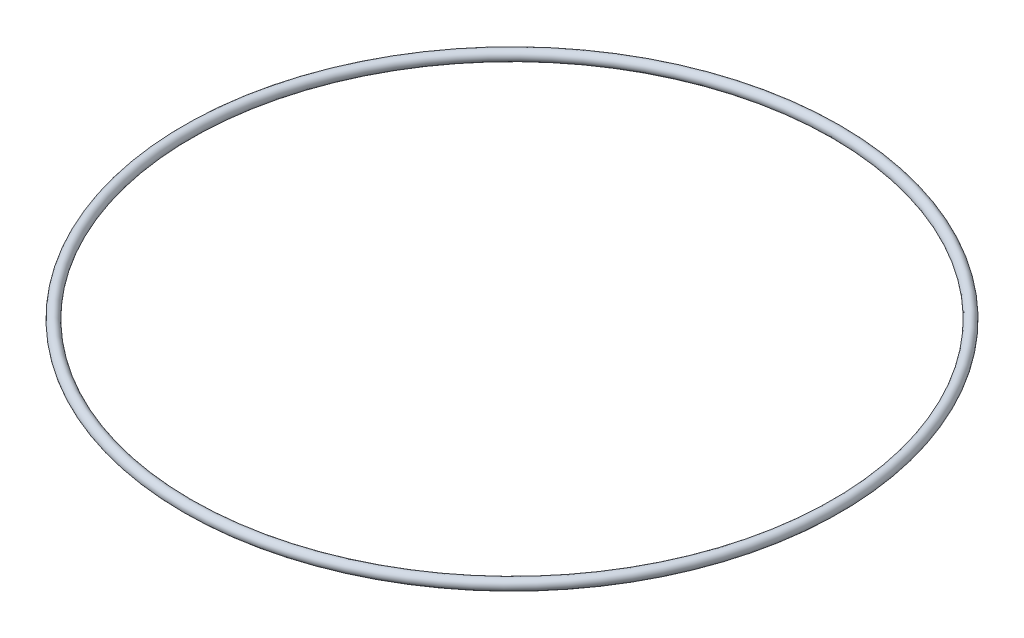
ISO-10303-21;
HEADER;
FILE_DESCRIPTION(('STEP AP214'),'2;1');
FILE_NAME('part.step','',(''),(''),'','','');
FILE_SCHEMA(('AUTOMOTIVE_DESIGN { 1 0 10303 214 1 1 1 1 }'));
ENDSEC;
DATA;
#1=APPLICATION_CONTEXT('core data for automotive mechanical design processes');
#2=APPLICATION_PROTOCOL_DEFINITION('international standard','automotive_design',2000,#1);
#3=PRODUCT_CONTEXT('',#1,'mechanical');
#4=PRODUCT('Part','Part','',(#3));
#5=PRODUCT_RELATED_PRODUCT_CATEGORY('part','',(#4));
#6=PRODUCT_DEFINITION_FORMATION('','',#4);
#7=PRODUCT_DEFINITION_CONTEXT('part definition',#1,'design');
#8=PRODUCT_DEFINITION('design','',#6,#7);
#9=PRODUCT_DEFINITION_SHAPE('','',#8);
#10=(LENGTH_UNIT() NAMED_UNIT(*) SI_UNIT(.MILLI.,.METRE.));
#11=(NAMED_UNIT(*) PLANE_ANGLE_UNIT() SI_UNIT($,.RADIAN.));
#12=(NAMED_UNIT(*) SI_UNIT($,.STERADIAN.) SOLID_ANGLE_UNIT());
#13=UNCERTAINTY_MEASURE_WITH_UNIT(LENGTH_MEASURE(1.E-05),#10,'distance_accuracy_value','');
#14=(GEOMETRIC_REPRESENTATION_CONTEXT(3) GLOBAL_UNCERTAINTY_ASSIGNED_CONTEXT((#13)) GLOBAL_UNIT_ASSIGNED_CONTEXT((#10,
#11,#12)) REPRESENTATION_CONTEXT('',''));
#15=CARTESIAN_POINT('',(0.,0.,0.));
#16=DIRECTION('',(0.,0.,1.));
#17=DIRECTION('',(1.,0.,0.));
#18=AXIS2_PLACEMENT_3D('',#15,#16,#17);
#19=CARTESIAN_POINT('',(0.,0.,0.));
#20=DIRECTION('',(0.,1.,0.));
#21=DIRECTION('',(0.,0.,1.));
#22=AXIS2_PLACEMENT_3D('',#19,#20,#21);
#23=TOROIDAL_SURFACE('',#22,92.5,1.5);
#24=CARTESIAN_POINT('',(0.,0.,94.));
#25=VERTEX_POINT('',#24);
#26=VERTEX_LOOP('',#25);
#27=FACE_BOUND('',#26,.T.);
#28=ADVANCED_FACE('F29',(#27),#23,.T.);
#29=CLOSED_SHELL('',(#28));
#30=MANIFOLD_SOLID_BREP('B2',#29);
#31=ADVANCED_BREP_SHAPE_REPRESENTATION('',(#18,#30),#14);
#32=SHAPE_DEFINITION_REPRESENTATION(#9,#31);
ENDSEC;
END-ISO-10303-21;
